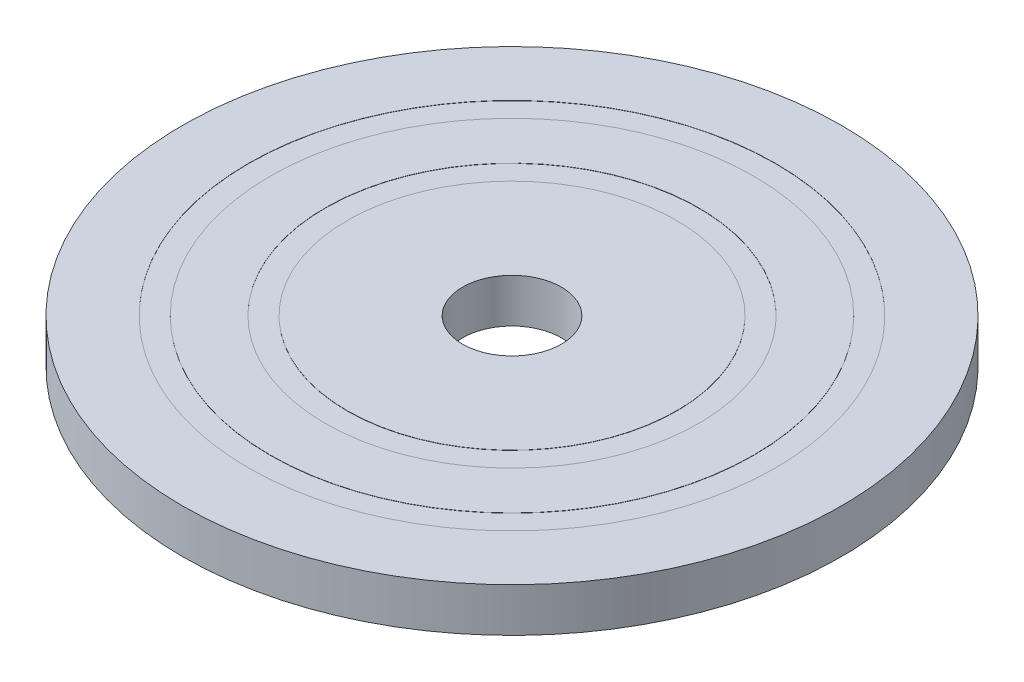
from build123d import *

# Parameters (mm, degrees)
SKETCH1_R      = 15
SKETCH1_R_2    = 2.25
EXTRUDE1_DEPTH = 2
SKETCH2_R      = 12
SKETCH2_R_2    = 11
SKETCH2_R_3    = 8.5
SKETCH2_R_4    = 7.5
EXTRUDE2_DEPTH = 0.01


with BuildPart() as part:
    # Sketch1 → Extrude1 (new body)
    with BuildSketch(Plane(origin=(0, 0, 0), x_dir=(1, 0, 0), z_dir=(0, 1, 0))):
        with Locations(Location((0, 0, 0), (0, 0, 270))):
            Circle(SKETCH1_R)
        with Locations(Location((0, 0, 0), (0, 0, 270))):
            Circle(SKETCH1_R_2, mode=Mode.SUBTRACT)
    extrude(amount=EXTRUDE1_DEPTH)

    # Sketch2 → Extrude2 (cut)
    # profile 1 of 2: a face of its own
    with BuildSketch(Plane(origin=(0, 2, 0), x_dir=(1, 0, 0), z_dir=(0, 1, 0))):
        with Locations(Location((0, 0, 0), (0, 0, 270))):
            Circle(SKETCH2_R)
        with Locations(Location((0, 0, 0), (0, 0, 270))):
            Circle(SKETCH2_R_2, mode=Mode.SUBTRACT)
    # profile 2 of 2: a face of its own
    with BuildSketch(Plane(origin=(0, 2, 0), x_dir=(1, 0, 0), z_dir=(0, 1, 0))):
        with Locations(Location((0, 0, 0), (0, 0, 270))):
            Circle(SKETCH2_R_3)
        with Locations(Location((0, 0, 0), (0, 0, 270))):
            Circle(SKETCH2_R_4, mode=Mode.SUBTRACT)
    extrude(amount=-EXTRUDE2_DEPTH, mode=Mode.SUBTRACT)


solid = part.part
